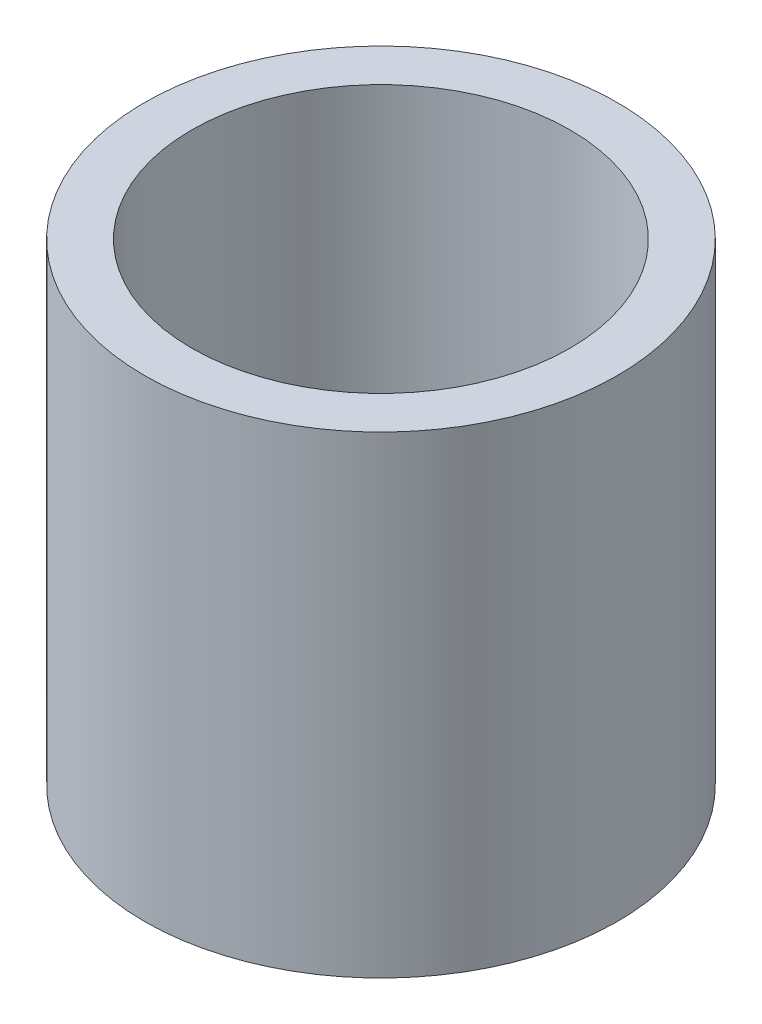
from build123d import *

# Parameters (mm, degrees)
SKETCH2_R           = 50
SKETCH2_R_2         = 40
BOSS_EXTRUDE1_DEPTH = 100


with BuildPart() as part:
    # Sketch2 → Boss-Extrude1 (new body)
    with BuildSketch(Plane(origin=(0, 0, 0), x_dir=(1, 0, 0), z_dir=(0, 1, 0))):
        with Locations(Location((0, 0, 0), (0, 0, 270))):
            Circle(SKETCH2_R)
        with Locations(Location((0, 0, 0), (0, 0, 270))):
            Circle(SKETCH2_R_2, mode=Mode.SUBTRACT)
    extrude(amount=BOSS_EXTRUDE1_DEPTH)


solid = part.part
